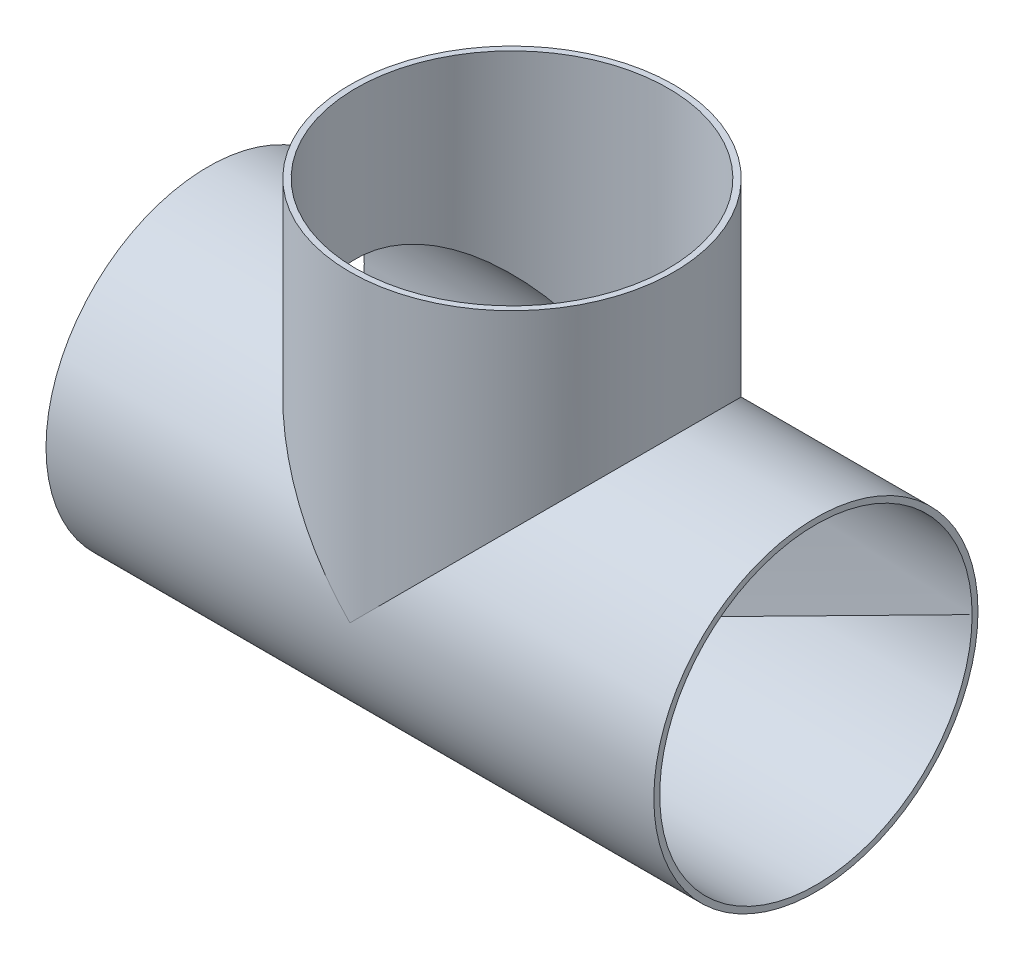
from build123d import *

# Parameters (mm, degrees)
SKETCH1_R           = 76.2
BOSS_EXTRUDE1_DEPTH = 142.875
SKETCH2_R           = 76.2
BOSS_EXTRUDE2_DEPTH = 142.875
SKETCH3_R           = 73.4314
CUT_EXTRUDE1_DEPTH  = 142.875
SKETCH4_R           = 73.4314
CUT_EXTRUDE2_DEPTH  = 142.875


with BuildPart() as part:
    # Sketch1 → Boss-Extrude1 (new, symmetric)
    with BuildSketch(Plane(origin=(0, 0, 0), x_dir=(0, 0, -1), z_dir=(1, 0, 0))):
        Circle(SKETCH1_R)
    extrude(amount=BOSS_EXTRUDE1_DEPTH, both=True)

    # Sketch2 → Boss-Extrude2 (add)
    with BuildSketch(Plane(origin=(0, 0, 0), x_dir=(1, 0, 0), z_dir=(0, 1, 0))):
        with Locations(Location((0, 0, 0), (0, 0, 270))):
            Circle(SKETCH2_R)
    extrude(amount=BOSS_EXTRUDE2_DEPTH)

    # Sketch3 → Cut-Extrude1 (cut)
    with BuildSketch(Plane(origin=(0, 0, 0), x_dir=(1, 0, 0), z_dir=(0, 1, 0))):
        with Locations(Location((0, 0, 0), (0, 0, 270))):
            Circle(SKETCH3_R)
    extrude(amount=CUT_EXTRUDE1_DEPTH, mode=Mode.SUBTRACT)

    # Sketch4 → Cut-Extrude2 (cut, symmetric)
    with BuildSketch(Plane(origin=(0, 0, 0), x_dir=(0, 0, -1), z_dir=(1, 0, 0))):
        Circle(SKETCH4_R)
    extrude(amount=CUT_EXTRUDE2_DEPTH, both=True, mode=Mode.SUBTRACT)


solid = part.part
